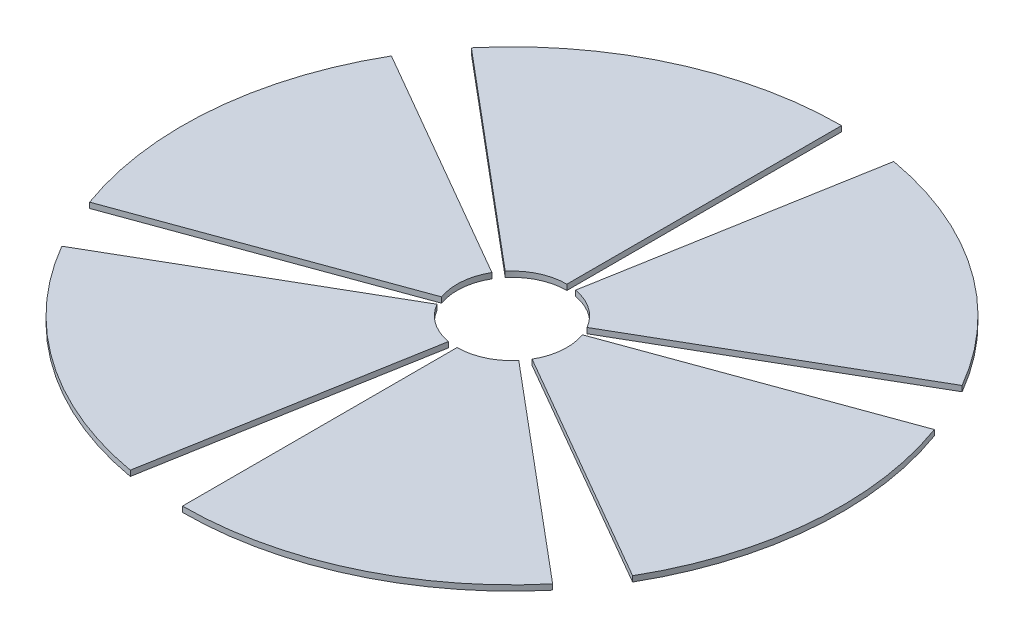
ISO-10303-21;
HEADER;
FILE_DESCRIPTION(('STEP AP214'),'2;1');
FILE_NAME('part.step','',(''),(''),'','','');
FILE_SCHEMA(('AUTOMOTIVE_DESIGN { 1 0 10303 214 1 1 1 1 }'));
ENDSEC;
DATA;
#1=APPLICATION_CONTEXT('core data for automotive mechanical design processes');
#2=APPLICATION_PROTOCOL_DEFINITION('international standard','automotive_design',2000,#1);
#3=PRODUCT_CONTEXT('',#1,'mechanical');
#4=PRODUCT('Part','Part','',(#3));
#5=PRODUCT_RELATED_PRODUCT_CATEGORY('part','',(#4));
#6=PRODUCT_DEFINITION_FORMATION('','',#4);
#7=PRODUCT_DEFINITION_CONTEXT('part definition',#1,'design');
#8=PRODUCT_DEFINITION('design','',#6,#7);
#9=PRODUCT_DEFINITION_SHAPE('','',#8);
#10=(LENGTH_UNIT() NAMED_UNIT(*) SI_UNIT(.MILLI.,.METRE.));
#11=(NAMED_UNIT(*) PLANE_ANGLE_UNIT() SI_UNIT($,.RADIAN.));
#12=(NAMED_UNIT(*) SI_UNIT($,.STERADIAN.) SOLID_ANGLE_UNIT());
#13=UNCERTAINTY_MEASURE_WITH_UNIT(LENGTH_MEASURE(1.E-05),#10,'distance_accuracy_value','');
#14=(GEOMETRIC_REPRESENTATION_CONTEXT(3) GLOBAL_UNCERTAINTY_ASSIGNED_CONTEXT((#13)) GLOBAL_UNIT_ASSIGNED_CONTEXT((#10,
#11,#12)) REPRESENTATION_CONTEXT('',''));
#15=CARTESIAN_POINT('',(0.,0.,0.));
#16=DIRECTION('',(0.,0.,1.));
#17=DIRECTION('',(1.,0.,0.));
#18=AXIS2_PLACEMENT_3D('',#15,#16,#17);
#19=CARTESIAN_POINT('',(0.,12.7,0.));
#20=DIRECTION('',(0.,-1.,0.));
#21=DIRECTION('',(0.,0.,-1.));
#22=AXIS2_PLACEMENT_3D('',#19,#20,#21);
#23=CYLINDRICAL_SURFACE('',#22,127.);
#24=CARTESIAN_POINT('',(0.,0.,0.));
#25=DIRECTION('',(0.,1.,0.));
#26=DIRECTION('',(0.,0.,1.));
#27=AXIS2_PLACEMENT_3D('',#24,#25,#26);
#28=CIRCLE('',#27,127.);
#29=CARTESIAN_POINT('',(0.,0.,-127.));
#30=VERTEX_POINT('',#29);
#31=CARTESIAN_POINT('',(-97.2876442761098,0.,-81.634026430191));
#32=VERTEX_POINT('',#31);
#33=EDGE_CURVE('E203',#30,#32,#28,.T.);
#34=ORIENTED_EDGE('',*,*,#33,.F.);
#35=DIRECTION('',(0.,-1.,0.));
#36=VECTOR('',#35,1.);
#37=CARTESIAN_POINT('',(0.,12.7,-127.));
#38=LINE('',#37,#36);
#39=CARTESIAN_POINT('',(0.,12.7,-127.));
#40=VERTEX_POINT('',#39);
#41=EDGE_CURVE('E13',#40,#30,#38,.T.);
#42=ORIENTED_EDGE('',*,*,#41,.F.);
#43=CARTESIAN_POINT('',(0.,12.7,0.));
#44=DIRECTION('',(0.,1.,0.));
#45=DIRECTION('',(0.,0.,1.));
#46=AXIS2_PLACEMENT_3D('',#43,#44,#45);
#47=CIRCLE('',#46,127.);
#48=CARTESIAN_POINT('',(-97.2876442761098,12.7,-81.634026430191));
#49=VERTEX_POINT('',#48);
#50=EDGE_CURVE('E188',#40,#49,#47,.T.);
#51=ORIENTED_EDGE('',*,*,#50,.T.);
#52=DIRECTION('',(0.,-1.,0.));
#53=VECTOR('',#52,1.);
#54=CARTESIAN_POINT('',(-97.2876442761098,12.7,-81.634026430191));
#55=LINE('',#54,#53);
#56=EDGE_CURVE('E156',#49,#32,#55,.T.);
#57=ORIENTED_EDGE('',*,*,#56,.T.);
#58=EDGE_LOOP('',(#34,#42,#51,#57));
#59=FACE_BOUND('',#58,.T.);
#60=ADVANCED_FACE('F140',(#59),#23,.F.);
#61=CARTESIAN_POINT('',(0.,12.7,0.));
#62=DIRECTION('',(-1.,0.,0.));
#63=DIRECTION('',(0.,0.,1.));
#64=AXIS2_PLACEMENT_3D('',#61,#62,#63);
#65=PLANE('',#64);
#66=DIRECTION('',(0.,0.,-1.));
#67=VECTOR('',#66,1.);
#68=CARTESIAN_POINT('',(0.,0.,0.));
#69=LINE('',#68,#67);
#70=CARTESIAN_POINT('',(0.,0.,-762.));
#71=VERTEX_POINT('',#70);
#72=EDGE_CURVE('E194',#30,#71,#69,.T.);
#73=ORIENTED_EDGE('',*,*,#72,.T.);
#74=DIRECTION('',(0.,-1.,0.));
#75=VECTOR('',#74,1.);
#76=CARTESIAN_POINT('',(0.,12.7,-762.));
#77=LINE('',#76,#75);
#78=CARTESIAN_POINT('',(0.,12.7,-762.));
#79=VERTEX_POINT('',#78);
#80=EDGE_CURVE('E148',#79,#71,#77,.T.);
#81=ORIENTED_EDGE('',*,*,#80,.F.);
#82=DIRECTION('',(0.,0.,-1.));
#83=VECTOR('',#82,1.);
#84=CARTESIAN_POINT('',(0.,12.7,0.));
#85=LINE('',#84,#83);
#86=EDGE_CURVE('E182',#40,#79,#85,.T.);
#87=ORIENTED_EDGE('',*,*,#86,.F.);
#88=ORIENTED_EDGE('',*,*,#41,.T.);
#89=EDGE_LOOP('',(#73,#81,#87,#88));
#90=FACE_BOUND('',#89,.T.);
#91=ADVANCED_FACE('F192',(#90),#65,.F.);
#92=CARTESIAN_POINT('',(0.,12.7,0.));
#93=DIRECTION('',(0.,-1.,0.));
#94=DIRECTION('',(0.,0.,-1.));
#95=AXIS2_PLACEMENT_3D('',#92,#93,#94);
#96=CYLINDRICAL_SURFACE('',#95,762.);
#97=CARTESIAN_POINT('',(0.,0.,0.));
#98=DIRECTION('',(0.,1.,0.));
#99=DIRECTION('',(0.,0.,1.));
#100=AXIS2_PLACEMENT_3D('',#97,#98,#99);
#101=CIRCLE('',#100,762.);
#102=CARTESIAN_POINT('',(-583.725865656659,0.,-489.804158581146));
#103=VERTEX_POINT('',#102);
#104=EDGE_CURVE('E206',#71,#103,#101,.T.);
#105=ORIENTED_EDGE('',*,*,#104,.T.);
#106=DIRECTION('',(0.,-1.,0.));
#107=VECTOR('',#106,1.);
#108=CARTESIAN_POINT('',(-583.725865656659,12.7,-489.804158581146));
#109=LINE('',#108,#107);
#110=CARTESIAN_POINT('',(-583.725865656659,12.7,-489.804158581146));
#111=VERTEX_POINT('',#110);
#112=EDGE_CURVE('E170',#111,#103,#109,.T.);
#113=ORIENTED_EDGE('',*,*,#112,.F.);
#114=CARTESIAN_POINT('',(0.,12.7,0.));
#115=DIRECTION('',(0.,1.,0.));
#116=DIRECTION('',(0.,0.,1.));
#117=AXIS2_PLACEMENT_3D('',#114,#115,#116);
#118=CIRCLE('',#117,762.);
#119=EDGE_CURVE('E187',#79,#111,#118,.T.);
#120=ORIENTED_EDGE('',*,*,#119,.F.);
#121=ORIENTED_EDGE('',*,*,#80,.T.);
#122=EDGE_LOOP('',(#105,#113,#120,#121));
#123=FACE_BOUND('',#122,.T.);
#124=ADVANCED_FACE('F197',(#123),#96,.T.);
#125=CARTESIAN_POINT('',(0.,12.7,0.));
#126=DIRECTION('',(-0.642787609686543,0.,0.766044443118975));
#127=DIRECTION('',(0.766044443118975,0.,0.642787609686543));
#128=AXIS2_PLACEMENT_3D('',#125,#126,#127);
#129=PLANE('',#128);
#130=DIRECTION('',(-0.766044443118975,0.,-0.642787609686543));
#131=VECTOR('',#130,1.);
#132=CARTESIAN_POINT('',(0.,0.,0.));
#133=LINE('',#132,#131);
#134=EDGE_CURVE('E208',#32,#103,#133,.T.);
#135=ORIENTED_EDGE('',*,*,#134,.F.);
#136=ORIENTED_EDGE('',*,*,#56,.F.);
#137=DIRECTION('',(-0.766044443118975,0.,-0.642787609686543));
#138=VECTOR('',#137,1.);
#139=CARTESIAN_POINT('',(0.,12.7,0.));
#140=LINE('',#139,#138);
#141=EDGE_CURVE('E198',#49,#111,#140,.T.);
#142=ORIENTED_EDGE('',*,*,#141,.T.);
#143=ORIENTED_EDGE('',*,*,#112,.T.);
#144=EDGE_LOOP('',(#135,#136,#142,#143));
#145=FACE_BOUND('',#144,.T.);
#146=ADVANCED_FACE('F213',(#145),#129,.T.);
#147=CARTESIAN_POINT('',(0.,12.7,0.));
#148=DIRECTION('',(0.,1.,0.));
#149=DIRECTION('',(0.,0.,1.));
#150=AXIS2_PLACEMENT_3D('',#147,#148,#149);
#151=PLANE('',#150);
#152=ORIENTED_EDGE('',*,*,#50,.F.);
#153=ORIENTED_EDGE('',*,*,#86,.T.);
#154=ORIENTED_EDGE('',*,*,#119,.T.);
#155=ORIENTED_EDGE('',*,*,#141,.F.);
#156=EDGE_LOOP('',(#152,#153,#154,#155));
#157=FACE_BOUND('',#156,.T.);
#158=ADVANCED_FACE('F184',(#157),#151,.T.);
#159=CARTESIAN_POINT('',(0.,0.,0.));
#160=DIRECTION('',(0.,1.,0.));
#161=DIRECTION('',(0.,0.,1.));
#162=AXIS2_PLACEMENT_3D('',#159,#160,#161);
#163=PLANE('',#162);
#164=ORIENTED_EDGE('',*,*,#33,.T.);
#165=ORIENTED_EDGE('',*,*,#134,.T.);
#166=ORIENTED_EDGE('',*,*,#104,.F.);
#167=ORIENTED_EDGE('',*,*,#72,.F.);
#168=EDGE_LOOP('',(#164,#165,#166,#167));
#169=FACE_BOUND('',#168,.T.);
#170=ADVANCED_FACE('F220',(#169),#163,.F.);
#171=CLOSED_SHELL('',(#60,#91,#124,#146,#158,#170));
#172=MANIFOLD_SOLID_BREP('B2',#171);
#173=CARTESIAN_POINT('',(0.,12.7,0.));
#174=DIRECTION('',(0.,-1.,0.));
#175=DIRECTION('',(0.,0.,-1.));
#176=AXIS2_PLACEMENT_3D('',#173,#174,#175);
#177=CYLINDRICAL_SURFACE('',#176,127.);
#178=CARTESIAN_POINT('',(0.,0.,0.));
#179=DIRECTION('',(0.,1.,0.));
#180=DIRECTION('',(0.,0.,1.));
#181=AXIS2_PLACEMENT_3D('',#178,#179,#180);
#182=CIRCLE('',#181,127.);
#183=CARTESIAN_POINT('',(109.985226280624,0.,-63.4999999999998));
#184=VERTEX_POINT('',#183);
#185=CARTESIAN_POINT('',(22.0533185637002,0.,-125.07058463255));
#186=VERTEX_POINT('',#185);
#187=EDGE_CURVE('E340',#184,#186,#182,.T.);
#188=ORIENTED_EDGE('',*,*,#187,.F.);
#189=DIRECTION('',(0.,-1.,0.));
#190=VECTOR('',#189,1.);
#191=CARTESIAN_POINT('',(109.985226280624,12.7,-63.4999999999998));
#192=LINE('',#191,#190);
#193=CARTESIAN_POINT('',(109.985226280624,12.7,-63.4999999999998));
#194=VERTEX_POINT('',#193);
#195=EDGE_CURVE('E138',#194,#184,#192,.T.);
#196=ORIENTED_EDGE('',*,*,#195,.F.);
#197=CARTESIAN_POINT('',(0.,12.7,0.));
#198=DIRECTION('',(0.,1.,0.));
#199=DIRECTION('',(0.,0.,1.));
#200=AXIS2_PLACEMENT_3D('',#197,#198,#199);
#201=CIRCLE('',#200,127.);
#202=CARTESIAN_POINT('',(22.0533185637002,12.7,-125.07058463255));
#203=VERTEX_POINT('',#202);
#204=EDGE_CURVE('E325',#194,#203,#201,.T.);
#205=ORIENTED_EDGE('',*,*,#204,.T.);
#206=DIRECTION('',(0.,-1.,0.));
#207=VECTOR('',#206,1.);
#208=CARTESIAN_POINT('',(22.0533185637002,12.7,-125.07058463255));
#209=LINE('',#208,#207);
#210=EDGE_CURVE('E293',#203,#186,#209,.T.);
#211=ORIENTED_EDGE('',*,*,#210,.T.);
#212=EDGE_LOOP('',(#188,#196,#205,#211));
#213=FACE_BOUND('',#212,.T.);
#214=ADVANCED_FACE('F277',(#213),#177,.F.);
#215=CARTESIAN_POINT('',(0.,12.7,0.));
#216=DIRECTION('',(-0.499999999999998,0.,-0.86602540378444));
#217=DIRECTION('',(-0.86602540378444,0.,0.499999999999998));
#218=AXIS2_PLACEMENT_3D('',#215,#216,#217);
#219=PLANE('',#218);
#220=DIRECTION('',(0.86602540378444,0.,-0.499999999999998));
#221=VECTOR('',#220,1.);
#222=CARTESIAN_POINT('',(0.,0.,0.));
#223=LINE('',#222,#221);
#224=CARTESIAN_POINT('',(659.911357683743,0.,-380.999999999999));
#225=VERTEX_POINT('',#224);
#226=EDGE_CURVE('E331',#184,#225,#223,.T.);
#227=ORIENTED_EDGE('',*,*,#226,.T.);
#228=DIRECTION('',(0.,-1.,0.));
#229=VECTOR('',#228,1.);
#230=CARTESIAN_POINT('',(659.911357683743,12.7,-380.999999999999));
#231=LINE('',#230,#229);
#232=CARTESIAN_POINT('',(659.911357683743,12.7,-380.999999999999));
#233=VERTEX_POINT('',#232);
#234=EDGE_CURVE('E285',#233,#225,#231,.T.);
#235=ORIENTED_EDGE('',*,*,#234,.F.);
#236=DIRECTION('',(0.86602540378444,0.,-0.499999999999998));
#237=VECTOR('',#236,1.);
#238=CARTESIAN_POINT('',(0.,12.7,0.));
#239=LINE('',#238,#237);
#240=EDGE_CURVE('E319',#194,#233,#239,.T.);
#241=ORIENTED_EDGE('',*,*,#240,.F.);
#242=ORIENTED_EDGE('',*,*,#195,.T.);
#243=EDGE_LOOP('',(#227,#235,#241,#242));
#244=FACE_BOUND('',#243,.T.);
#245=ADVANCED_FACE('F329',(#244),#219,.F.);
#246=CARTESIAN_POINT('',(0.,12.7,0.));
#247=DIRECTION('',(0.,-1.,0.));
#248=DIRECTION('',(0.,0.,-1.));
#249=AXIS2_PLACEMENT_3D('',#246,#247,#248);
#250=CYLINDRICAL_SURFACE('',#249,762.);
#251=CARTESIAN_POINT('',(0.,0.,0.));
#252=DIRECTION('',(0.,1.,0.));
#253=DIRECTION('',(0.,0.,1.));
#254=AXIS2_PLACEMENT_3D('',#251,#252,#253);
#255=CIRCLE('',#254,762.);
#256=CARTESIAN_POINT('',(132.319911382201,0.,-750.423507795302));
#257=VERTEX_POINT('',#256);
#258=EDGE_CURVE('E343',#225,#257,#255,.T.);
#259=ORIENTED_EDGE('',*,*,#258,.T.);
#260=DIRECTION('',(0.,-1.,0.));
#261=VECTOR('',#260,1.);
#262=CARTESIAN_POINT('',(132.319911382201,12.7,-750.423507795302));
#263=LINE('',#262,#261);
#264=CARTESIAN_POINT('',(132.319911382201,12.7,-750.423507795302));
#265=VERTEX_POINT('',#264);
#266=EDGE_CURVE('E307',#265,#257,#263,.T.);
#267=ORIENTED_EDGE('',*,*,#266,.F.);
#268=CARTESIAN_POINT('',(0.,12.7,0.));
#269=DIRECTION('',(0.,1.,0.));
#270=DIRECTION('',(0.,0.,1.));
#271=AXIS2_PLACEMENT_3D('',#268,#269,#270);
#272=CIRCLE('',#271,762.);
#273=EDGE_CURVE('E324',#233,#265,#272,.T.);
#274=ORIENTED_EDGE('',*,*,#273,.F.);
#275=ORIENTED_EDGE('',*,*,#234,.T.);
#276=EDGE_LOOP('',(#259,#267,#274,#275));
#277=FACE_BOUND('',#276,.T.);
#278=ADVANCED_FACE('F334',(#277),#250,.T.);
#279=CARTESIAN_POINT('',(0.,12.7,0.));
#280=DIRECTION('',(-0.984807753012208,0.,-0.173648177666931));
#281=DIRECTION('',(-0.173648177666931,0.,0.984807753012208));
#282=AXIS2_PLACEMENT_3D('',#279,#280,#281);
#283=PLANE('',#282);
#284=DIRECTION('',(0.173648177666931,0.,-0.984807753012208));
#285=VECTOR('',#284,1.);
#286=CARTESIAN_POINT('',(0.,0.,0.));
#287=LINE('',#286,#285);
#288=EDGE_CURVE('E345',#186,#257,#287,.T.);
#289=ORIENTED_EDGE('',*,*,#288,.F.);
#290=ORIENTED_EDGE('',*,*,#210,.F.);
#291=DIRECTION('',(0.173648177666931,0.,-0.984807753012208));
#292=VECTOR('',#291,1.);
#293=CARTESIAN_POINT('',(0.,12.7,0.));
#294=LINE('',#293,#292);
#295=EDGE_CURVE('E335',#203,#265,#294,.T.);
#296=ORIENTED_EDGE('',*,*,#295,.T.);
#297=ORIENTED_EDGE('',*,*,#266,.T.);
#298=EDGE_LOOP('',(#289,#290,#296,#297));
#299=FACE_BOUND('',#298,.T.);
#300=ADVANCED_FACE('F350',(#299),#283,.T.);
#301=CARTESIAN_POINT('',(0.,12.7,0.));
#302=DIRECTION('',(0.,1.,0.));
#303=DIRECTION('',(0.,0.,1.));
#304=AXIS2_PLACEMENT_3D('',#301,#302,#303);
#305=PLANE('',#304);
#306=ORIENTED_EDGE('',*,*,#204,.F.);
#307=ORIENTED_EDGE('',*,*,#240,.T.);
#308=ORIENTED_EDGE('',*,*,#273,.T.);
#309=ORIENTED_EDGE('',*,*,#295,.F.);
#310=EDGE_LOOP('',(#306,#307,#308,#309));
#311=FACE_BOUND('',#310,.T.);
#312=ADVANCED_FACE('F321',(#311),#305,.T.);
#313=CARTESIAN_POINT('',(0.,0.,0.));
#314=DIRECTION('',(0.,1.,0.));
#315=DIRECTION('',(0.,0.,1.));
#316=AXIS2_PLACEMENT_3D('',#313,#314,#315);
#317=PLANE('',#316);
#318=ORIENTED_EDGE('',*,*,#187,.T.);
#319=ORIENTED_EDGE('',*,*,#288,.T.);
#320=ORIENTED_EDGE('',*,*,#258,.F.);
#321=ORIENTED_EDGE('',*,*,#226,.F.);
#322=EDGE_LOOP('',(#318,#319,#320,#321));
#323=FACE_BOUND('',#322,.T.);
#324=ADVANCED_FACE('F357',(#323),#317,.F.);
#325=CLOSED_SHELL('',(#214,#245,#278,#300,#312,#324));
#326=MANIFOLD_SOLID_BREP('B7',#325);
#327=CARTESIAN_POINT('',(0.,12.7,0.));
#328=DIRECTION('',(0.,-1.,0.));
#329=DIRECTION('',(0.,0.,-1.));
#330=AXIS2_PLACEMENT_3D('',#327,#328,#329);
#331=CYLINDRICAL_SURFACE('',#330,127.);
#332=CARTESIAN_POINT('',(0.,0.,0.));
#333=DIRECTION('',(0.,1.,0.));
#334=DIRECTION('',(0.,0.,1.));
#335=AXIS2_PLACEMENT_3D('',#332,#333,#334);
#336=CIRCLE('',#335,127.);
#337=CARTESIAN_POINT('',(109.985226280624,0.,63.4999999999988));
#338=VERTEX_POINT('',#337);
#339=CARTESIAN_POINT('',(119.34096283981,0.,-43.4365582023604));
#340=VERTEX_POINT('',#339);
#341=EDGE_CURVE('E473',#338,#340,#336,.T.);
#342=ORIENTED_EDGE('',*,*,#341,.F.);
#343=DIRECTION('',(0.,-1.,0.));
#344=VECTOR('',#343,1.);
#345=CARTESIAN_POINT('',(109.985226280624,12.7,63.4999999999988));
#346=LINE('',#345,#344);
#347=CARTESIAN_POINT('',(109.985226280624,12.7,63.4999999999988));
#348=VERTEX_POINT('',#347);
#349=EDGE_CURVE('E275',#348,#338,#346,.T.);
#350=ORIENTED_EDGE('',*,*,#349,.F.);
#351=CARTESIAN_POINT('',(0.,12.7,0.));
#352=DIRECTION('',(0.,1.,0.));
#353=DIRECTION('',(0.,0.,1.));
#354=AXIS2_PLACEMENT_3D('',#351,#352,#353);
#355=CIRCLE('',#354,127.);
#356=CARTESIAN_POINT('',(119.34096283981,12.7,-43.4365582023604));
#357=VERTEX_POINT('',#356);
#358=EDGE_CURVE('E461',#348,#357,#355,.T.);
#359=ORIENTED_EDGE('',*,*,#358,.T.);
#360=DIRECTION('',(0.,-1.,0.));
#361=VECTOR('',#360,1.);
#362=CARTESIAN_POINT('',(119.34096283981,12.7,-43.4365582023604));
#363=LINE('',#362,#361);
#364=EDGE_CURVE('E450',#357,#340,#363,.T.);
#365=ORIENTED_EDGE('',*,*,#364,.T.);
#366=EDGE_LOOP('',(#342,#350,#359,#365));
#367=FACE_BOUND('',#366,.T.);
#368=ADVANCED_FACE('F411',(#367),#331,.F.);
#369=CARTESIAN_POINT('',(0.,12.7,0.));
#370=DIRECTION('',(0.499999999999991,0.,-0.866025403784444));
#371=DIRECTION('',(-0.866025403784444,0.,-0.499999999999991));
#372=AXIS2_PLACEMENT_3D('',#369,#370,#371);
#373=PLANE('',#372);
#374=DIRECTION('',(0.866025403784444,0.,0.499999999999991));
#375=VECTOR('',#374,1.);
#376=CARTESIAN_POINT('',(0.,0.,0.));
#377=LINE('',#376,#375);
#378=CARTESIAN_POINT('',(659.911357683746,0.,380.999999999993));
#379=VERTEX_POINT('',#378);
#380=EDGE_CURVE('E466',#338,#379,#377,.T.);
#381=ORIENTED_EDGE('',*,*,#380,.T.);
#382=DIRECTION('',(0.,-1.,0.));
#383=VECTOR('',#382,1.);
#384=CARTESIAN_POINT('',(659.911357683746,12.7,380.999999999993));
#385=LINE('',#384,#383);
#386=CARTESIAN_POINT('',(659.911357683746,12.7,380.999999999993));
#387=VERTEX_POINT('',#386);
#388=EDGE_CURVE('E419',#387,#379,#385,.T.);
#389=ORIENTED_EDGE('',*,*,#388,.F.);
#390=DIRECTION('',(0.866025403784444,0.,0.499999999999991));
#391=VECTOR('',#390,1.);
#392=CARTESIAN_POINT('',(0.,12.7,0.));
#393=LINE('',#392,#391);
#394=EDGE_CURVE('E456',#348,#387,#393,.T.);
#395=ORIENTED_EDGE('',*,*,#394,.F.);
#396=ORIENTED_EDGE('',*,*,#349,.T.);
#397=EDGE_LOOP('',(#381,#389,#395,#396));
#398=FACE_BOUND('',#397,.T.);
#399=ADVANCED_FACE('F464',(#398),#373,.F.);
#400=CARTESIAN_POINT('',(0.,12.7,0.));
#401=DIRECTION('',(0.,-1.,0.));
#402=DIRECTION('',(0.,0.,-1.));
#403=AXIS2_PLACEMENT_3D('',#400,#401,#402);
#404=CYLINDRICAL_SURFACE('',#403,762.);
#405=CARTESIAN_POINT('',(0.,0.,0.));
#406=DIRECTION('',(0.,1.,0.));
#407=DIRECTION('',(0.,0.,1.));
#408=AXIS2_PLACEMENT_3D('',#405,#406,#407);
#409=CIRCLE('',#408,762.);
#410=CARTESIAN_POINT('',(716.045777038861,0.,-260.619349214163));
#411=VERTEX_POINT('',#410);
#412=EDGE_CURVE('E443',#379,#411,#409,.T.);
#413=ORIENTED_EDGE('',*,*,#412,.T.);
#414=DIRECTION('',(0.,-1.,0.));
#415=VECTOR('',#414,1.);
#416=CARTESIAN_POINT('',(716.045777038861,12.7,-260.619349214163));
#417=LINE('',#416,#415);
#418=CARTESIAN_POINT('',(716.045777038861,12.7,-260.619349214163));
#419=VERTEX_POINT('',#418);
#420=EDGE_CURVE('E467',#419,#411,#417,.T.);
#421=ORIENTED_EDGE('',*,*,#420,.F.);
#422=CARTESIAN_POINT('',(0.,12.7,0.));
#423=DIRECTION('',(0.,1.,0.));
#424=DIRECTION('',(0.,0.,1.));
#425=AXIS2_PLACEMENT_3D('',#422,#423,#424);
#426=CIRCLE('',#425,762.);
#427=EDGE_CURVE('E460',#387,#419,#426,.T.);
#428=ORIENTED_EDGE('',*,*,#427,.F.);
#429=ORIENTED_EDGE('',*,*,#388,.T.);
#430=EDGE_LOOP('',(#413,#421,#428,#429));
#431=FACE_BOUND('',#430,.T.);
#432=ADVANCED_FACE('F468',(#431),#404,.T.);
#433=CARTESIAN_POINT('',(0.,12.7,0.));
#434=DIRECTION('',(0.342020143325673,0.,0.939692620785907));
#435=DIRECTION('',(0.939692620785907,0.,-0.342020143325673));
#436=AXIS2_PLACEMENT_3D('',#433,#434,#435);
#437=PLANE('',#436);
#438=DIRECTION('',(-0.939692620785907,0.,0.342020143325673));
#439=VECTOR('',#438,1.);
#440=CARTESIAN_POINT('',(0.,0.,0.));
#441=LINE('',#440,#439);
#442=EDGE_CURVE('E478',#411,#340,#441,.T.);
#443=ORIENTED_EDGE('',*,*,#442,.T.);
#444=ORIENTED_EDGE('',*,*,#364,.F.);
#445=DIRECTION('',(-0.939692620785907,0.,0.342020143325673));
#446=VECTOR('',#445,1.);
#447=CARTESIAN_POINT('',(0.,12.7,0.));
#448=LINE('',#447,#446);
#449=EDGE_CURVE('E427',#419,#357,#448,.T.);
#450=ORIENTED_EDGE('',*,*,#449,.F.);
#451=ORIENTED_EDGE('',*,*,#420,.T.);
#452=EDGE_LOOP('',(#443,#444,#450,#451));
#453=FACE_BOUND('',#452,.T.);
#454=ADVANCED_FACE('F483',(#453),#437,.F.);
#455=CARTESIAN_POINT('',(0.,12.7,0.));
#456=DIRECTION('',(0.,1.,0.));
#457=DIRECTION('',(0.,0.,1.));
#458=AXIS2_PLACEMENT_3D('',#455,#456,#457);
#459=PLANE('',#458);
#460=ORIENTED_EDGE('',*,*,#358,.F.);
#461=ORIENTED_EDGE('',*,*,#394,.T.);
#462=ORIENTED_EDGE('',*,*,#427,.T.);
#463=ORIENTED_EDGE('',*,*,#449,.T.);
#464=EDGE_LOOP('',(#460,#461,#462,#463));
#465=FACE_BOUND('',#464,.T.);
#466=ADVANCED_FACE('F458',(#465),#459,.T.);
#467=CARTESIAN_POINT('',(0.,0.,0.));
#468=DIRECTION('',(0.,1.,0.));
#469=DIRECTION('',(0.,0.,1.));
#470=AXIS2_PLACEMENT_3D('',#467,#468,#469);
#471=PLANE('',#470);
#472=ORIENTED_EDGE('',*,*,#341,.T.);
#473=ORIENTED_EDGE('',*,*,#442,.F.);
#474=ORIENTED_EDGE('',*,*,#412,.F.);
#475=ORIENTED_EDGE('',*,*,#380,.F.);
#476=EDGE_LOOP('',(#472,#473,#474,#475));
#477=FACE_BOUND('',#476,.T.);
#478=ADVANCED_FACE('F485',(#477),#471,.F.);
#479=CLOSED_SHELL('',(#368,#399,#432,#454,#466,#478));
#480=MANIFOLD_SOLID_BREP('B132',#479);
#481=CARTESIAN_POINT('',(0.,12.7,0.));
#482=DIRECTION('',(0.,-1.,0.));
#483=DIRECTION('',(0.,0.,-1.));
#484=AXIS2_PLACEMENT_3D('',#481,#482,#483);
#485=CYLINDRICAL_SURFACE('',#484,127.);
#486=CARTESIAN_POINT('',(0.,0.,0.));
#487=DIRECTION('',(0.,1.,0.));
#488=DIRECTION('',(0.,0.,1.));
#489=AXIS2_PLACEMENT_3D('',#486,#487,#488);
#490=CIRCLE('',#489,127.);
#491=CARTESIAN_POINT('',(1.02928776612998E-12,0.,127.));
#492=VERTEX_POINT('',#491);
#493=CARTESIAN_POINT('',(97.287644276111,0.,81.6340264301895));
#494=VERTEX_POINT('',#493);
#495=EDGE_CURVE('E608',#492,#494,#490,.T.);
#496=ORIENTED_EDGE('',*,*,#495,.F.);
#497=DIRECTION('',(0.,-1.,0.));
#498=VECTOR('',#497,1.);
#499=CARTESIAN_POINT('',(1.02928776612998E-12,12.7,127.));
#500=LINE('',#499,#498);
#501=CARTESIAN_POINT('',(1.02928776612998E-12,12.7,127.));
#502=VERTEX_POINT('',#501);
#503=EDGE_CURVE('E409',#502,#492,#500,.T.);
#504=ORIENTED_EDGE('',*,*,#503,.F.);
#505=CARTESIAN_POINT('',(0.,12.7,0.));
#506=DIRECTION('',(0.,1.,0.));
#507=DIRECTION('',(0.,0.,1.));
#508=AXIS2_PLACEMENT_3D('',#505,#506,#507);
#509=CIRCLE('',#508,127.);
#510=CARTESIAN_POINT('',(97.287644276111,12.7,81.6340264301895));
#511=VERTEX_POINT('',#510);
#512=EDGE_CURVE('E593',#502,#511,#509,.T.);
#513=ORIENTED_EDGE('',*,*,#512,.T.);
#514=DIRECTION('',(0.,-1.,0.));
#515=VECTOR('',#514,1.);
#516=CARTESIAN_POINT('',(97.287644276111,12.7,81.6340264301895));
#517=LINE('',#516,#515);
#518=EDGE_CURVE('E561',#511,#494,#517,.T.);
#519=ORIENTED_EDGE('',*,*,#518,.T.);
#520=EDGE_LOOP('',(#496,#504,#513,#519));
#521=FACE_BOUND('',#520,.T.);
#522=ADVANCED_FACE('F545',(#521),#485,.F.);
#523=CARTESIAN_POINT('',(0.,12.7,0.));
#524=DIRECTION('',(1.,0.,0.));
#525=DIRECTION('',(0.,0.,-1.));
#526=AXIS2_PLACEMENT_3D('',#523,#524,#525);
#527=PLANE('',#526);
#528=DIRECTION('',(0.,0.,1.));
#529=VECTOR('',#528,1.);
#530=CARTESIAN_POINT('',(0.,0.,0.));
#531=LINE('',#530,#529);
#532=CARTESIAN_POINT('',(6.1757265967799E-12,0.,762.));
#533=VERTEX_POINT('',#532);
#534=EDGE_CURVE('E599',#492,#533,#531,.T.);
#535=ORIENTED_EDGE('',*,*,#534,.T.);
#536=DIRECTION('',(0.,-1.,0.));
#537=VECTOR('',#536,1.);
#538=CARTESIAN_POINT('',(6.1757265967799E-12,12.7,762.));
#539=LINE('',#538,#537);
#540=CARTESIAN_POINT('',(6.1757265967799E-12,12.7,762.));
#541=VERTEX_POINT('',#540);
#542=EDGE_CURVE('E553',#541,#533,#539,.T.);
#543=ORIENTED_EDGE('',*,*,#542,.F.);
#544=DIRECTION('',(0.,0.,1.));
#545=VECTOR('',#544,1.);
#546=CARTESIAN_POINT('',(0.,12.7,0.));
#547=LINE('',#546,#545);
#548=EDGE_CURVE('E587',#502,#541,#547,.T.);
#549=ORIENTED_EDGE('',*,*,#548,.F.);
#550=ORIENTED_EDGE('',*,*,#503,.T.);
#551=EDGE_LOOP('',(#535,#543,#549,#550));
#552=FACE_BOUND('',#551,.T.);
#553=ADVANCED_FACE('F597',(#552),#527,.F.);
#554=CARTESIAN_POINT('',(0.,12.7,0.));
#555=DIRECTION('',(0.,-1.,0.));
#556=DIRECTION('',(0.,0.,-1.));
#557=AXIS2_PLACEMENT_3D('',#554,#555,#556);
#558=CYLINDRICAL_SURFACE('',#557,762.);
#559=CARTESIAN_POINT('',(0.,0.,0.));
#560=DIRECTION('',(0.,1.,0.));
#561=DIRECTION('',(0.,0.,1.));
#562=AXIS2_PLACEMENT_3D('',#559,#560,#561);
#563=CIRCLE('',#562,762.);
#564=CARTESIAN_POINT('',(583.725865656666,0.,489.804158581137));
#565=VERTEX_POINT('',#564);
#566=EDGE_CURVE('E611',#533,#565,#563,.T.);
#567=ORIENTED_EDGE('',*,*,#566,.T.);
#568=DIRECTION('',(0.,-1.,0.));
#569=VECTOR('',#568,1.);
#570=CARTESIAN_POINT('',(583.725865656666,12.7,489.804158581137));
#571=LINE('',#570,#569);
#572=CARTESIAN_POINT('',(583.725865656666,12.7,489.804158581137));
#573=VERTEX_POINT('',#572);
#574=EDGE_CURVE('E575',#573,#565,#571,.T.);
#575=ORIENTED_EDGE('',*,*,#574,.F.);
#576=CARTESIAN_POINT('',(0.,12.7,0.));
#577=DIRECTION('',(0.,1.,0.));
#578=DIRECTION('',(0.,0.,1.));
#579=AXIS2_PLACEMENT_3D('',#576,#577,#578);
#580=CIRCLE('',#579,762.);
#581=EDGE_CURVE('E592',#541,#573,#580,.T.);
#582=ORIENTED_EDGE('',*,*,#581,.F.);
#583=ORIENTED_EDGE('',*,*,#542,.T.);
#584=EDGE_LOOP('',(#567,#575,#582,#583));
#585=FACE_BOUND('',#584,.T.);
#586=ADVANCED_FACE('F602',(#585),#558,.T.);
#587=CARTESIAN_POINT('',(0.,12.7,0.));
#588=DIRECTION('',(0.642787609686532,0.,-0.766044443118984));
#589=DIRECTION('',(-0.766044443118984,0.,-0.642787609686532));
#590=AXIS2_PLACEMENT_3D('',#587,#588,#589);
#591=PLANE('',#590);
#592=DIRECTION('',(0.766044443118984,0.,0.642787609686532));
#593=VECTOR('',#592,1.);
#594=CARTESIAN_POINT('',(0.,0.,0.));
#595=LINE('',#594,#593);
#596=EDGE_CURVE('E613',#494,#565,#595,.T.);
#597=ORIENTED_EDGE('',*,*,#596,.F.);
#598=ORIENTED_EDGE('',*,*,#518,.F.);
#599=DIRECTION('',(0.766044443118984,0.,0.642787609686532));
#600=VECTOR('',#599,1.);
#601=CARTESIAN_POINT('',(0.,12.7,0.));
#602=LINE('',#601,#600);
#603=EDGE_CURVE('E603',#511,#573,#602,.T.);
#604=ORIENTED_EDGE('',*,*,#603,.T.);
#605=ORIENTED_EDGE('',*,*,#574,.T.);
#606=EDGE_LOOP('',(#597,#598,#604,#605));
#607=FACE_BOUND('',#606,.T.);
#608=ADVANCED_FACE('F618',(#607),#591,.T.);
#609=CARTESIAN_POINT('',(0.,12.7,0.));
#610=DIRECTION('',(0.,1.,0.));
#611=DIRECTION('',(0.,0.,1.));
#612=AXIS2_PLACEMENT_3D('',#609,#610,#611);
#613=PLANE('',#612);
#614=ORIENTED_EDGE('',*,*,#512,.F.);
#615=ORIENTED_EDGE('',*,*,#548,.T.);
#616=ORIENTED_EDGE('',*,*,#581,.T.);
#617=ORIENTED_EDGE('',*,*,#603,.F.);
#618=EDGE_LOOP('',(#614,#615,#616,#617));
#619=FACE_BOUND('',#618,.T.);
#620=ADVANCED_FACE('F589',(#619),#613,.T.);
#621=CARTESIAN_POINT('',(0.,0.,0.));
#622=DIRECTION('',(0.,1.,0.));
#623=DIRECTION('',(0.,0.,1.));
#624=AXIS2_PLACEMENT_3D('',#621,#622,#623);
#625=PLANE('',#624);
#626=ORIENTED_EDGE('',*,*,#495,.T.);
#627=ORIENTED_EDGE('',*,*,#596,.T.);
#628=ORIENTED_EDGE('',*,*,#566,.F.);
#629=ORIENTED_EDGE('',*,*,#534,.F.);
#630=EDGE_LOOP('',(#626,#627,#628,#629));
#631=FACE_BOUND('',#630,.T.);
#632=ADVANCED_FACE('F625',(#631),#625,.F.);
#633=CLOSED_SHELL('',(#522,#553,#586,#608,#620,#632));
#634=MANIFOLD_SOLID_BREP('B269',#633);
#635=CARTESIAN_POINT('',(0.,12.7,0.));
#636=DIRECTION('',(0.,-1.,0.));
#637=DIRECTION('',(0.,0.,-1.));
#638=AXIS2_PLACEMENT_3D('',#635,#636,#637);
#639=CYLINDRICAL_SURFACE('',#638,127.);
#640=CARTESIAN_POINT('',(0.,0.,0.));
#641=DIRECTION('',(0.,1.,0.));
#642=DIRECTION('',(0.,0.,1.));
#643=AXIS2_PLACEMENT_3D('',#640,#641,#642);
#644=CIRCLE('',#643,127.);
#645=CARTESIAN_POINT('',(-109.985226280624,0.,63.4999999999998));
#646=VERTEX_POINT('',#645);
#647=CARTESIAN_POINT('',(-22.0533185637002,0.,125.07058463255));
#648=VERTEX_POINT('',#647);
#649=EDGE_CURVE('E741',#646,#648,#644,.T.);
#650=ORIENTED_EDGE('',*,*,#649,.F.);
#651=DIRECTION('',(0.,-1.,0.));
#652=VECTOR('',#651,1.);
#653=CARTESIAN_POINT('',(-109.985226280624,12.7,63.4999999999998));
#654=LINE('',#653,#652);
#655=CARTESIAN_POINT('',(-109.985226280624,12.7,63.4999999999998));
#656=VERTEX_POINT('',#655);
#657=EDGE_CURVE('E543',#656,#646,#654,.T.);
#658=ORIENTED_EDGE('',*,*,#657,.F.);
#659=CARTESIAN_POINT('',(0.,12.7,0.));
#660=DIRECTION('',(0.,1.,0.));
#661=DIRECTION('',(0.,0.,1.));
#662=AXIS2_PLACEMENT_3D('',#659,#660,#661);
#663=CIRCLE('',#662,127.);
#664=CARTESIAN_POINT('',(-22.0533185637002,12.7,125.07058463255));
#665=VERTEX_POINT('',#664);
#666=EDGE_CURVE('E726',#656,#665,#663,.T.);
#667=ORIENTED_EDGE('',*,*,#666,.T.);
#668=DIRECTION('',(0.,-1.,0.));
#669=VECTOR('',#668,1.);
#670=CARTESIAN_POINT('',(-22.0533185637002,12.7,125.07058463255));
#671=LINE('',#670,#669);
#672=EDGE_CURVE('E694',#665,#648,#671,.T.);
#673=ORIENTED_EDGE('',*,*,#672,.T.);
#674=EDGE_LOOP('',(#650,#658,#667,#673));
#675=FACE_BOUND('',#674,.T.);
#676=ADVANCED_FACE('F678',(#675),#639,.F.);
#677=CARTESIAN_POINT('',(0.,12.7,0.));
#678=DIRECTION('',(0.499999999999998,0.,0.86602540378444));
#679=DIRECTION('',(0.86602540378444,0.,-0.499999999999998));
#680=AXIS2_PLACEMENT_3D('',#677,#678,#679);
#681=PLANE('',#680);
#682=DIRECTION('',(-0.86602540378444,0.,0.499999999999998));
#683=VECTOR('',#682,1.);
#684=CARTESIAN_POINT('',(0.,0.,0.));
#685=LINE('',#684,#683);
#686=CARTESIAN_POINT('',(-659.911357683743,0.,380.999999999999));
#687=VERTEX_POINT('',#686);
#688=EDGE_CURVE('E732',#646,#687,#685,.T.);
#689=ORIENTED_EDGE('',*,*,#688,.T.);
#690=DIRECTION('',(0.,-1.,0.));
#691=VECTOR('',#690,1.);
#692=CARTESIAN_POINT('',(-659.911357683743,12.7,380.999999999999));
#693=LINE('',#692,#691);
#694=CARTESIAN_POINT('',(-659.911357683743,12.7,380.999999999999));
#695=VERTEX_POINT('',#694);
#696=EDGE_CURVE('E686',#695,#687,#693,.T.);
#697=ORIENTED_EDGE('',*,*,#696,.F.);
#698=DIRECTION('',(-0.86602540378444,0.,0.499999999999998));
#699=VECTOR('',#698,1.);
#700=CARTESIAN_POINT('',(0.,12.7,0.));
#701=LINE('',#700,#699);
#702=EDGE_CURVE('E720',#656,#695,#701,.T.);
#703=ORIENTED_EDGE('',*,*,#702,.F.);
#704=ORIENTED_EDGE('',*,*,#657,.T.);
#705=EDGE_LOOP('',(#689,#697,#703,#704));
#706=FACE_BOUND('',#705,.T.);
#707=ADVANCED_FACE('F730',(#706),#681,.F.);
#708=CARTESIAN_POINT('',(0.,12.7,0.));
#709=DIRECTION('',(0.,-1.,0.));
#710=DIRECTION('',(0.,0.,-1.));
#711=AXIS2_PLACEMENT_3D('',#708,#709,#710);
#712=CYLINDRICAL_SURFACE('',#711,762.);
#713=CARTESIAN_POINT('',(0.,0.,0.));
#714=DIRECTION('',(0.,1.,0.));
#715=DIRECTION('',(0.,0.,1.));
#716=AXIS2_PLACEMENT_3D('',#713,#714,#715);
#717=CIRCLE('',#716,762.);
#718=CARTESIAN_POINT('',(-132.319911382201,0.,750.423507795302));
#719=VERTEX_POINT('',#718);
#720=EDGE_CURVE('E744',#687,#719,#717,.T.);
#721=ORIENTED_EDGE('',*,*,#720,.T.);
#722=DIRECTION('',(0.,-1.,0.));
#723=VECTOR('',#722,1.);
#724=CARTESIAN_POINT('',(-132.319911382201,12.7,750.423507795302));
#725=LINE('',#724,#723);
#726=CARTESIAN_POINT('',(-132.319911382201,12.7,750.423507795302));
#727=VERTEX_POINT('',#726);
#728=EDGE_CURVE('E708',#727,#719,#725,.T.);
#729=ORIENTED_EDGE('',*,*,#728,.F.);
#730=CARTESIAN_POINT('',(0.,12.7,0.));
#731=DIRECTION('',(0.,1.,0.));
#732=DIRECTION('',(0.,0.,1.));
#733=AXIS2_PLACEMENT_3D('',#730,#731,#732);
#734=CIRCLE('',#733,762.);
#735=EDGE_CURVE('E725',#695,#727,#734,.T.);
#736=ORIENTED_EDGE('',*,*,#735,.F.);
#737=ORIENTED_EDGE('',*,*,#696,.T.);
#738=EDGE_LOOP('',(#721,#729,#736,#737));
#739=FACE_BOUND('',#738,.T.);
#740=ADVANCED_FACE('F735',(#739),#712,.T.);
#741=CARTESIAN_POINT('',(0.,12.7,0.));
#742=DIRECTION('',(0.984807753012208,0.,0.173648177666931));
#743=DIRECTION('',(0.173648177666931,0.,-0.984807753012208));
#744=AXIS2_PLACEMENT_3D('',#741,#742,#743);
#745=PLANE('',#744);
#746=DIRECTION('',(-0.173648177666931,0.,0.984807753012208));
#747=VECTOR('',#746,1.);
#748=CARTESIAN_POINT('',(0.,0.,0.));
#749=LINE('',#748,#747);
#750=EDGE_CURVE('E746',#648,#719,#749,.T.);
#751=ORIENTED_EDGE('',*,*,#750,.F.);
#752=ORIENTED_EDGE('',*,*,#672,.F.);
#753=DIRECTION('',(-0.173648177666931,0.,0.984807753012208));
#754=VECTOR('',#753,1.);
#755=CARTESIAN_POINT('',(0.,12.7,0.));
#756=LINE('',#755,#754);
#757=EDGE_CURVE('E736',#665,#727,#756,.T.);
#758=ORIENTED_EDGE('',*,*,#757,.T.);
#759=ORIENTED_EDGE('',*,*,#728,.T.);
#760=EDGE_LOOP('',(#751,#752,#758,#759));
#761=FACE_BOUND('',#760,.T.);
#762=ADVANCED_FACE('F751',(#761),#745,.T.);
#763=CARTESIAN_POINT('',(0.,12.7,0.));
#764=DIRECTION('',(0.,1.,0.));
#765=DIRECTION('',(0.,0.,1.));
#766=AXIS2_PLACEMENT_3D('',#763,#764,#765);
#767=PLANE('',#766);
#768=ORIENTED_EDGE('',*,*,#666,.F.);
#769=ORIENTED_EDGE('',*,*,#702,.T.);
#770=ORIENTED_EDGE('',*,*,#735,.T.);
#771=ORIENTED_EDGE('',*,*,#757,.F.);
#772=EDGE_LOOP('',(#768,#769,#770,#771));
#773=FACE_BOUND('',#772,.T.);
#774=ADVANCED_FACE('F722',(#773),#767,.T.);
#775=CARTESIAN_POINT('',(0.,0.,0.));
#776=DIRECTION('',(0.,1.,0.));
#777=DIRECTION('',(0.,0.,1.));
#778=AXIS2_PLACEMENT_3D('',#775,#776,#777);
#779=PLANE('',#778);
#780=ORIENTED_EDGE('',*,*,#649,.T.);
#781=ORIENTED_EDGE('',*,*,#750,.T.);
#782=ORIENTED_EDGE('',*,*,#720,.F.);
#783=ORIENTED_EDGE('',*,*,#688,.F.);
#784=EDGE_LOOP('',(#780,#781,#782,#783));
#785=FACE_BOUND('',#784,.T.);
#786=ADVANCED_FACE('F758',(#785),#779,.F.);
#787=CLOSED_SHELL('',(#676,#707,#740,#762,#774,#786));
#788=MANIFOLD_SOLID_BREP('B403',#787);
#789=CARTESIAN_POINT('',(0.,12.7,0.));
#790=DIRECTION('',(-0.500000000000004,0.,0.866025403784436));
#791=DIRECTION('',(0.866025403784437,0.,0.500000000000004));
#792=AXIS2_PLACEMENT_3D('',#789,#790,#791);
#793=PLANE('',#792);
#794=DIRECTION('',(-0.866025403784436,0.,-0.500000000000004));
#795=VECTOR('',#794,1.);
#796=CARTESIAN_POINT('',(0.,0.,0.));
#797=LINE('',#796,#795);
#798=CARTESIAN_POINT('',(-109.985226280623,0.,-63.5000000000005));
#799=VERTEX_POINT('',#798);
#800=CARTESIAN_POINT('',(-659.911357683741,0.,-381.000000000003));
#801=VERTEX_POINT('',#800);
#802=EDGE_CURVE('E868',#799,#801,#797,.T.);
#803=ORIENTED_EDGE('',*,*,#802,.T.);
#804=DIRECTION('',(0.,-1.,0.));
#805=VECTOR('',#804,1.);
#806=CARTESIAN_POINT('',(-659.911357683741,12.7,-381.000000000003));
#807=LINE('',#806,#805);
#808=CARTESIAN_POINT('',(-659.911357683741,12.7,-381.000000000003));
#809=VERTEX_POINT('',#808);
#810=EDGE_CURVE('E676',#809,#801,#807,.T.);
#811=ORIENTED_EDGE('',*,*,#810,.F.);
#812=DIRECTION('',(-0.866025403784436,0.,-0.500000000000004));
#813=VECTOR('',#812,1.);
#814=CARTESIAN_POINT('',(0.,12.7,0.));
#815=LINE('',#814,#813);
#816=CARTESIAN_POINT('',(-109.985226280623,12.7,-63.5000000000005));
#817=VERTEX_POINT('',#816);
#818=EDGE_CURVE('E854',#817,#809,#815,.T.);
#819=ORIENTED_EDGE('',*,*,#818,.F.);
#820=DIRECTION('',(0.,-1.,0.));
#821=VECTOR('',#820,1.);
#822=CARTESIAN_POINT('',(-109.985226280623,12.7,-63.5000000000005));
#823=LINE('',#822,#821);
#824=EDGE_CURVE('E821',#817,#799,#823,.T.);
#825=ORIENTED_EDGE('',*,*,#824,.T.);
#826=EDGE_LOOP('',(#803,#811,#819,#825));
#827=FACE_BOUND('',#826,.T.);
#828=ADVANCED_FACE('F805',(#827),#793,.F.);
#829=CARTESIAN_POINT('',(0.,12.7,0.));
#830=DIRECTION('',(0.,-1.,0.));
#831=DIRECTION('',(0.,0.,-1.));
#832=AXIS2_PLACEMENT_3D('',#829,#830,#831);
#833=CYLINDRICAL_SURFACE('',#832,762.);
#834=CARTESIAN_POINT('',(0.,0.,0.));
#835=DIRECTION('',(0.,1.,0.));
#836=DIRECTION('',(0.,0.,1.));
#837=AXIS2_PLACEMENT_3D('',#834,#835,#836);
#838=CIRCLE('',#837,762.);
#839=CARTESIAN_POINT('',(-716.045777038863,0.,260.619349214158));
#840=VERTEX_POINT('',#839);
#841=EDGE_CURVE('E859',#801,#840,#838,.T.);
#842=ORIENTED_EDGE('',*,*,#841,.T.);
#843=DIRECTION('',(0.,-1.,0.));
#844=VECTOR('',#843,1.);
#845=CARTESIAN_POINT('',(-716.045777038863,12.7,260.619349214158));
#846=LINE('',#845,#844);
#847=CARTESIAN_POINT('',(-716.045777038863,12.7,260.619349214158));
#848=VERTEX_POINT('',#847);
#849=EDGE_CURVE('E813',#848,#840,#846,.T.);
#850=ORIENTED_EDGE('',*,*,#849,.F.);
#851=CARTESIAN_POINT('',(0.,12.7,0.));
#852=DIRECTION('',(0.,1.,0.));
#853=DIRECTION('',(0.,0.,1.));
#854=AXIS2_PLACEMENT_3D('',#851,#852,#853);
#855=CIRCLE('',#854,762.);
#856=EDGE_CURVE('E846',#809,#848,#855,.T.);
#857=ORIENTED_EDGE('',*,*,#856,.F.);
#858=ORIENTED_EDGE('',*,*,#810,.T.);
#859=EDGE_LOOP('',(#842,#850,#857,#858));
#860=FACE_BOUND('',#859,.T.);
#861=ADVANCED_FACE('F858',(#860),#833,.T.);
#862=CARTESIAN_POINT('',(0.,12.7,0.));
#863=DIRECTION('',(0.342020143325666,0.,0.939692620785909));
#864=DIRECTION('',(0.939692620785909,0.,-0.342020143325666));
#865=AXIS2_PLACEMENT_3D('',#862,#863,#864);
#866=PLANE('',#865);
#867=DIRECTION('',(-0.939692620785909,0.,0.342020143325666));
#868=VECTOR('',#867,1.);
#869=CARTESIAN_POINT('',(0.,0.,0.));
#870=LINE('',#869,#868);
#871=CARTESIAN_POINT('',(-119.34096283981,0.,43.4365582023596));
#872=VERTEX_POINT('',#871);
#873=EDGE_CURVE('E871',#872,#840,#870,.T.);
#874=ORIENTED_EDGE('',*,*,#873,.F.);
#875=DIRECTION('',(0.,-1.,0.));
#876=VECTOR('',#875,1.);
#877=CARTESIAN_POINT('',(-119.34096283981,12.7,43.4365582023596));
#878=LINE('',#877,#876);
#879=CARTESIAN_POINT('',(-119.34096283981,12.7,43.4365582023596));
#880=VERTEX_POINT('',#879);
#881=EDGE_CURVE('E835',#880,#872,#878,.T.);
#882=ORIENTED_EDGE('',*,*,#881,.F.);
#883=DIRECTION('',(-0.939692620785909,0.,0.342020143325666));
#884=VECTOR('',#883,1.);
#885=CARTESIAN_POINT('',(0.,12.7,0.));
#886=LINE('',#885,#884);
#887=EDGE_CURVE('E853',#880,#848,#886,.T.);
#888=ORIENTED_EDGE('',*,*,#887,.T.);
#889=ORIENTED_EDGE('',*,*,#849,.T.);
#890=EDGE_LOOP('',(#874,#882,#888,#889));
#891=FACE_BOUND('',#890,.T.);
#892=ADVANCED_FACE('F862',(#891),#866,.T.);
#893=CARTESIAN_POINT('',(0.,12.7,0.));
#894=DIRECTION('',(0.,-1.,0.));
#895=DIRECTION('',(0.,0.,-1.));
#896=AXIS2_PLACEMENT_3D('',#893,#894,#895);
#897=CYLINDRICAL_SURFACE('',#896,127.);
#898=CARTESIAN_POINT('',(0.,0.,0.));
#899=DIRECTION('',(0.,1.,0.));
#900=DIRECTION('',(0.,0.,1.));
#901=AXIS2_PLACEMENT_3D('',#898,#899,#900);
#902=CIRCLE('',#901,127.);
#903=EDGE_CURVE('E873',#799,#872,#902,.T.);
#904=ORIENTED_EDGE('',*,*,#903,.F.);
#905=ORIENTED_EDGE('',*,*,#824,.F.);
#906=CARTESIAN_POINT('',(0.,12.7,0.));
#907=DIRECTION('',(0.,1.,0.));
#908=DIRECTION('',(0.,0.,1.));
#909=AXIS2_PLACEMENT_3D('',#906,#907,#908);
#910=CIRCLE('',#909,127.);
#911=EDGE_CURVE('E863',#817,#880,#910,.T.);
#912=ORIENTED_EDGE('',*,*,#911,.T.);
#913=ORIENTED_EDGE('',*,*,#881,.T.);
#914=EDGE_LOOP('',(#904,#905,#912,#913));
#915=FACE_BOUND('',#914,.T.);
#916=ADVANCED_FACE('F879',(#915),#897,.F.);
#917=CARTESIAN_POINT('',(0.,12.7,0.));
#918=DIRECTION('',(0.,1.,0.));
#919=DIRECTION('',(0.,0.,1.));
#920=AXIS2_PLACEMENT_3D('',#917,#918,#919);
#921=PLANE('',#920);
#922=ORIENTED_EDGE('',*,*,#818,.T.);
#923=ORIENTED_EDGE('',*,*,#856,.T.);
#924=ORIENTED_EDGE('',*,*,#887,.F.);
#925=ORIENTED_EDGE('',*,*,#911,.F.);
#926=EDGE_LOOP('',(#922,#923,#924,#925));
#927=FACE_BOUND('',#926,.T.);
#928=ADVANCED_FACE('F850',(#927),#921,.T.);
#929=CARTESIAN_POINT('',(0.,0.,0.));
#930=DIRECTION('',(0.,1.,0.));
#931=DIRECTION('',(0.,0.,1.));
#932=AXIS2_PLACEMENT_3D('',#929,#930,#931);
#933=PLANE('',#932);
#934=ORIENTED_EDGE('',*,*,#802,.F.);
#935=ORIENTED_EDGE('',*,*,#903,.T.);
#936=ORIENTED_EDGE('',*,*,#873,.T.);
#937=ORIENTED_EDGE('',*,*,#841,.F.);
#938=EDGE_LOOP('',(#934,#935,#936,#937));
#939=FACE_BOUND('',#938,.T.);
#940=ADVANCED_FACE('F878',(#939),#933,.F.);
#941=CLOSED_SHELL('',(#828,#861,#892,#916,#928,#940));
#942=MANIFOLD_SOLID_BREP('B537',#941);
#943=ADVANCED_BREP_SHAPE_REPRESENTATION('',(#18,#172,#326,#480,#634,#788,#942),#14);
#944=SHAPE_DEFINITION_REPRESENTATION(#9,#943);
ENDSEC;
END-ISO-10303-21;
